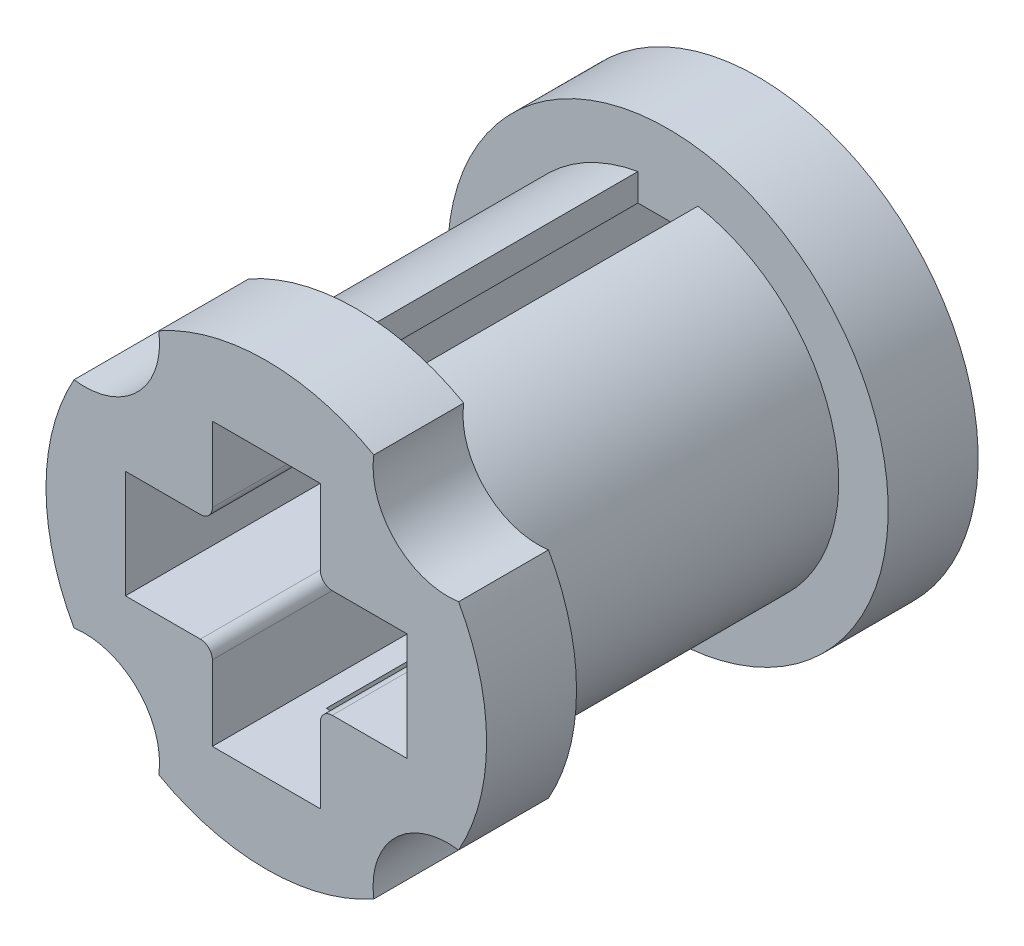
ISO-10303-21;
HEADER;
FILE_DESCRIPTION(('STEP AP214'),'2;1');
FILE_NAME('part.step','',(''),(''),'','','');
FILE_SCHEMA(('AUTOMOTIVE_DESIGN { 1 0 10303 214 1 1 1 1 }'));
ENDSEC;
DATA;
#1=APPLICATION_CONTEXT('core data for automotive mechanical design processes');
#2=APPLICATION_PROTOCOL_DEFINITION('international standard','automotive_design',2000,#1);
#3=PRODUCT_CONTEXT('',#1,'mechanical');
#4=PRODUCT('Part','Part','',(#3));
#5=PRODUCT_RELATED_PRODUCT_CATEGORY('part','',(#4));
#6=PRODUCT_DEFINITION_FORMATION('','',#4);
#7=PRODUCT_DEFINITION_CONTEXT('part definition',#1,'design');
#8=PRODUCT_DEFINITION('design','',#6,#7);
#9=PRODUCT_DEFINITION_SHAPE('','',#8);
#10=(LENGTH_UNIT() NAMED_UNIT(*) SI_UNIT(.MILLI.,.METRE.));
#11=(NAMED_UNIT(*) PLANE_ANGLE_UNIT() SI_UNIT($,.RADIAN.));
#12=(NAMED_UNIT(*) SI_UNIT($,.STERADIAN.) SOLID_ANGLE_UNIT());
#13=UNCERTAINTY_MEASURE_WITH_UNIT(LENGTH_MEASURE(1.E-05),#10,'distance_accuracy_value','');
#14=(GEOMETRIC_REPRESENTATION_CONTEXT(3) GLOBAL_UNCERTAINTY_ASSIGNED_CONTEXT((#13)) GLOBAL_UNIT_ASSIGNED_CONTEXT((#10,
#11,#12)) REPRESENTATION_CONTEXT('',''));
#15=CARTESIAN_POINT('',(0.,0.,0.));
#16=DIRECTION('',(0.,0.,1.));
#17=DIRECTION('',(1.,0.,0.));
#18=AXIS2_PLACEMENT_3D('',#15,#16,#17);
#19=CARTESIAN_POINT('',(0.,0.,-5.2));
#20=DIRECTION('',(0.,0.,1.));
#21=DIRECTION('',(1.,0.,0.));
#22=AXIS2_PLACEMENT_3D('',#19,#20,#21);
#23=CYLINDRICAL_SURFACE('',#22,2.85);
#24=DIRECTION('',(0.,0.,1.));
#25=VECTOR('',#24,1.);
#26=CARTESIAN_POINT('',(-0.500000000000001,-2.80579756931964,-5.2));
#27=LINE('',#26,#25);
#28=CARTESIAN_POINT('',(-0.5,-2.80579756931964,0.));
#29=VERTEX_POINT('',#28);
#30=CARTESIAN_POINT('',(-0.500000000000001,-2.80579756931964,-5.2));
#31=VERTEX_POINT('',#30);
#32=EDGE_CURVE('E246',#29,#31,#27,.F.);
#33=ORIENTED_EDGE('',*,*,#32,.F.);
#34=CARTESIAN_POINT('',(0.,0.,0.));
#35=DIRECTION('',(0.,0.,1.));
#36=DIRECTION('',(1.,0.,0.));
#37=AXIS2_PLACEMENT_3D('',#34,#35,#36);
#38=CIRCLE('',#37,2.85);
#39=CARTESIAN_POINT('',(-0.5,2.80579756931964,0.));
#40=VERTEX_POINT('',#39);
#41=EDGE_CURVE('E260',#40,#29,#38,.T.);
#42=ORIENTED_EDGE('',*,*,#41,.F.);
#43=DIRECTION('',(0.,0.,1.));
#44=VECTOR('',#43,1.);
#45=CARTESIAN_POINT('',(-0.500000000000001,2.80579756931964,-5.2));
#46=LINE('',#45,#44);
#47=CARTESIAN_POINT('',(-0.500000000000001,2.80579756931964,-5.2));
#48=VERTEX_POINT('',#47);
#49=EDGE_CURVE('E264',#48,#40,#46,.T.);
#50=ORIENTED_EDGE('',*,*,#49,.F.);
#51=CARTESIAN_POINT('',(0.,0.,-5.2));
#52=DIRECTION('',(0.,0.,-1.));
#53=DIRECTION('',(-1.,0.,0.));
#54=AXIS2_PLACEMENT_3D('',#51,#52,#53);
#55=CIRCLE('',#54,2.85);
#56=EDGE_CURVE('E262',#48,#31,#55,.F.);
#57=ORIENTED_EDGE('',*,*,#56,.T.);
#58=EDGE_LOOP('',(#33,#42,#50,#57));
#59=FACE_BOUND('',#58,.T.);
#60=ADVANCED_FACE('F33',(#59),#23,.T.);
#61=CARTESIAN_POINT('',(0.,0.,1.5));
#62=DIRECTION('',(0.,0.,-1.));
#63=DIRECTION('',(-1.,0.,0.));
#64=AXIS2_PLACEMENT_3D('',#61,#62,#63);
#65=CYLINDRICAL_SURFACE('',#64,3.675);
#66=CARTESIAN_POINT('',(0.,0.,0.));
#67=DIRECTION('',(0.,0.,1.));
#68=DIRECTION('',(1.,0.,0.));
#69=AXIS2_PLACEMENT_3D('',#66,#67,#68);
#70=CIRCLE('',#69,3.675);
#71=CARTESIAN_POINT('',(-1.79335399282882,-3.20772605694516,0.));
#72=VERTEX_POINT('',#71);
#73=CARTESIAN_POINT('',(1.79335399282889,-3.20772605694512,0.));
#74=VERTEX_POINT('',#73);
#75=EDGE_CURVE('E439',#72,#74,#70,.T.);
#76=ORIENTED_EDGE('',*,*,#75,.T.);
#77=DIRECTION('',(0.,0.,1.));
#78=VECTOR('',#77,1.);
#79=CARTESIAN_POINT('',(1.79335399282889,-3.20772605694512,0.75));
#80=LINE('',#79,#78);
#81=CARTESIAN_POINT('',(1.79335399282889,-3.20772605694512,1.5));
#82=VERTEX_POINT('',#81);
#83=EDGE_CURVE('E495',#74,#82,#80,.T.);
#84=ORIENTED_EDGE('',*,*,#83,.T.);
#85=CARTESIAN_POINT('',(0.,0.,1.5));
#86=DIRECTION('',(0.,0.,1.));
#87=DIRECTION('',(1.,0.,0.));
#88=AXIS2_PLACEMENT_3D('',#85,#86,#87);
#89=CIRCLE('',#88,3.675);
#90=CARTESIAN_POINT('',(-1.79335399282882,-3.20772605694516,1.5));
#91=VERTEX_POINT('',#90);
#92=EDGE_CURVE('E426',#91,#82,#89,.T.);
#93=ORIENTED_EDGE('',*,*,#92,.F.);
#94=DIRECTION('',(0.,0.,1.));
#95=VECTOR('',#94,1.);
#96=CARTESIAN_POINT('',(-1.79335399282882,-3.20772605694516,0.75));
#97=LINE('',#96,#95);
#98=EDGE_CURVE('E502',#91,#72,#97,.F.);
#99=ORIENTED_EDGE('',*,*,#98,.T.);
#100=EDGE_LOOP('',(#76,#84,#93,#99));
#101=FACE_BOUND('',#100,.T.);
#102=ADVANCED_FACE('F544',(#101),#65,.T.);
#103=CARTESIAN_POINT('',(-3.20772605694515,1.79335399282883,0.));
#104=VERTEX_POINT('',#103);
#105=CARTESIAN_POINT('',(-3.20772605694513,-1.79335399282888,0.));
#106=VERTEX_POINT('',#105);
#107=EDGE_CURVE('E431',#104,#106,#70,.T.);
#108=ORIENTED_EDGE('',*,*,#107,.T.);
#109=DIRECTION('',(0.,0.,1.));
#110=VECTOR('',#109,1.);
#111=CARTESIAN_POINT('',(-3.20772605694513,-1.79335399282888,0.75));
#112=LINE('',#111,#110);
#113=CARTESIAN_POINT('',(-3.20772605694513,-1.79335399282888,1.5));
#114=VERTEX_POINT('',#113);
#115=EDGE_CURVE('E506',#106,#114,#112,.T.);
#116=ORIENTED_EDGE('',*,*,#115,.T.);
#117=CARTESIAN_POINT('',(-3.20772605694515,1.79335399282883,1.5));
#118=VERTEX_POINT('',#117);
#119=EDGE_CURVE('E419',#118,#114,#89,.T.);
#120=ORIENTED_EDGE('',*,*,#119,.F.);
#121=DIRECTION('',(0.,0.,1.));
#122=VECTOR('',#121,1.);
#123=CARTESIAN_POINT('',(-3.20772605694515,1.79335399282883,0.75));
#124=LINE('',#123,#122);
#125=EDGE_CURVE('E513',#118,#104,#124,.F.);
#126=ORIENTED_EDGE('',*,*,#125,.T.);
#127=EDGE_LOOP('',(#108,#116,#120,#126));
#128=FACE_BOUND('',#127,.T.);
#129=ADVANCED_FACE('F533',(#128),#65,.T.);
#130=CARTESIAN_POINT('',(1.79335399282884,3.20772605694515,0.));
#131=VERTEX_POINT('',#130);
#132=CARTESIAN_POINT('',(-1.79335399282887,3.20772605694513,0.));
#133=VERTEX_POINT('',#132);
#134=EDGE_CURVE('E279',#131,#133,#70,.T.);
#135=ORIENTED_EDGE('',*,*,#134,.T.);
#136=DIRECTION('',(0.,0.,1.));
#137=VECTOR('',#136,1.);
#138=CARTESIAN_POINT('',(-1.79335399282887,3.20772605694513,0.75));
#139=LINE('',#138,#137);
#140=CARTESIAN_POINT('',(-1.79335399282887,3.20772605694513,1.5));
#141=VERTEX_POINT('',#140);
#142=EDGE_CURVE('E517',#133,#141,#139,.T.);
#143=ORIENTED_EDGE('',*,*,#142,.T.);
#144=CARTESIAN_POINT('',(1.79335399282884,3.20772605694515,1.5));
#145=VERTEX_POINT('',#144);
#146=EDGE_CURVE('E277',#145,#141,#89,.T.);
#147=ORIENTED_EDGE('',*,*,#146,.F.);
#148=DIRECTION('',(0.,0.,1.));
#149=VECTOR('',#148,1.);
#150=CARTESIAN_POINT('',(1.79335399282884,3.20772605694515,0.75));
#151=LINE('',#150,#149);
#152=EDGE_CURVE('E523',#145,#131,#151,.F.);
#153=ORIENTED_EDGE('',*,*,#152,.T.);
#154=EDGE_LOOP('',(#135,#143,#147,#153));
#155=FACE_BOUND('',#154,.T.);
#156=ADVANCED_FACE('F536',(#155),#65,.T.);
#157=DIRECTION('',(0.,0.,1.));
#158=VECTOR('',#157,1.);
#159=CARTESIAN_POINT('',(0.499999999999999,2.80579756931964,-5.2));
#160=LINE('',#159,#158);
#161=CARTESIAN_POINT('',(0.5,2.80579756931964,0.));
#162=VERTEX_POINT('',#161);
#163=CARTESIAN_POINT('',(0.499999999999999,2.80579756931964,-5.2));
#164=VERTEX_POINT('',#163);
#165=EDGE_CURVE('E452',#162,#164,#160,.F.);
#166=ORIENTED_EDGE('',*,*,#165,.F.);
#167=CARTESIAN_POINT('',(0.5,-2.80579756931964,0.));
#168=VERTEX_POINT('',#167);
#169=EDGE_CURVE('E272',#168,#162,#38,.T.);
#170=ORIENTED_EDGE('',*,*,#169,.F.);
#171=DIRECTION('',(0.,0.,1.));
#172=VECTOR('',#171,1.);
#173=CARTESIAN_POINT('',(0.499999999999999,-2.80579756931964,-5.2));
#174=LINE('',#173,#172);
#175=CARTESIAN_POINT('',(0.499999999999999,-2.80579756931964,-5.2));
#176=VERTEX_POINT('',#175);
#177=EDGE_CURVE('E454',#176,#168,#174,.T.);
#178=ORIENTED_EDGE('',*,*,#177,.F.);
#179=EDGE_CURVE('E417',#176,#164,#55,.F.);
#180=ORIENTED_EDGE('',*,*,#179,.T.);
#181=EDGE_LOOP('',(#166,#170,#178,#180));
#182=FACE_BOUND('',#181,.T.);
#183=ADVANCED_FACE('F450',(#182),#23,.T.);
#184=CARTESIAN_POINT('',(3.20772605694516,-1.79335399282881,1.5));
#185=VERTEX_POINT('',#184);
#186=CARTESIAN_POINT('',(3.20772605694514,1.79335399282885,1.5));
#187=VERTEX_POINT('',#186);
#188=EDGE_CURVE('E420',#185,#187,#89,.T.);
#189=ORIENTED_EDGE('',*,*,#188,.F.);
#190=DIRECTION('',(0.,0.,1.));
#191=VECTOR('',#190,1.);
#192=CARTESIAN_POINT('',(3.20772605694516,-1.79335399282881,0.75));
#193=LINE('',#192,#191);
#194=CARTESIAN_POINT('',(3.20772605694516,-1.79335399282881,0.));
#195=VERTEX_POINT('',#194);
#196=EDGE_CURVE('E492',#185,#195,#193,.F.);
#197=ORIENTED_EDGE('',*,*,#196,.T.);
#198=CARTESIAN_POINT('',(3.20772605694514,1.79335399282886,0.));
#199=VERTEX_POINT('',#198);
#200=EDGE_CURVE('E432',#195,#199,#70,.T.);
#201=ORIENTED_EDGE('',*,*,#200,.T.);
#202=DIRECTION('',(0.,0.,1.));
#203=VECTOR('',#202,1.);
#204=CARTESIAN_POINT('',(3.20772605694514,1.79335399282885,0.75));
#205=LINE('',#204,#203);
#206=EDGE_CURVE('E366',#199,#187,#205,.T.);
#207=ORIENTED_EDGE('',*,*,#206,.T.);
#208=EDGE_LOOP('',(#189,#197,#201,#207));
#209=FACE_BOUND('',#208,.T.);
#210=ADVANCED_FACE('F525',(#209),#65,.T.);
#211=CARTESIAN_POINT('',(0.,0.,1.5));
#212=DIRECTION('',(0.,0.,1.));
#213=DIRECTION('',(1.,0.,0.));
#214=AXIS2_PLACEMENT_3D('',#211,#212,#213);
#215=PLANE('',#214);
#216=CARTESIAN_POINT('',(3.03076442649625,-3.03076442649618,1.5));
#217=DIRECTION('',(0.,0.,1.));
#218=DIRECTION('',(0.,-1.,0.));
#219=AXIS2_PLACEMENT_3D('',#216,#217,#218);
#220=CIRCLE('',#219,1.25);
#221=EDGE_CURVE('E263',#185,#82,#220,.T.);
#222=ORIENTED_EDGE('',*,*,#221,.F.);
#223=ORIENTED_EDGE('',*,*,#188,.T.);
#224=CARTESIAN_POINT('',(3.03076442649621,3.03076442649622,1.5));
#225=DIRECTION('',(0.,0.,1.));
#226=DIRECTION('',(1.,0.,0.));
#227=AXIS2_PLACEMENT_3D('',#224,#225,#226);
#228=CIRCLE('',#227,1.25);
#229=EDGE_CURVE('E519',#145,#187,#228,.T.);
#230=ORIENTED_EDGE('',*,*,#229,.F.);
#231=ORIENTED_EDGE('',*,*,#146,.T.);
#232=CARTESIAN_POINT('',(-3.03076442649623,3.0307644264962,1.5));
#233=DIRECTION('',(0.,0.,1.));
#234=DIRECTION('',(0.,1.,0.));
#235=AXIS2_PLACEMENT_3D('',#232,#233,#234);
#236=CIRCLE('',#235,1.25);
#237=EDGE_CURVE('E509',#118,#141,#236,.T.);
#238=ORIENTED_EDGE('',*,*,#237,.F.);
#239=ORIENTED_EDGE('',*,*,#119,.T.);
#240=CARTESIAN_POINT('',(-3.03076442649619,-3.03076442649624,1.5));
#241=DIRECTION('',(0.,0.,1.));
#242=DIRECTION('',(-1.,0.,0.));
#243=AXIS2_PLACEMENT_3D('',#240,#241,#242);
#244=CIRCLE('',#243,1.25);
#245=EDGE_CURVE('E498',#91,#114,#244,.T.);
#246=ORIENTED_EDGE('',*,*,#245,.F.);
#247=ORIENTED_EDGE('',*,*,#92,.T.);
#248=EDGE_LOOP('',(#222,#223,#230,#231,#238,#239,#246,#247));
#249=FACE_BOUND('',#248,.T.);
#250=DIRECTION('',(0.,-1.,0.));
#251=VECTOR('',#250,1.);
#252=CARTESIAN_POINT('',(-0.900000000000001,-0.9,1.5));
#253=LINE('',#252,#251);
#254=CARTESIAN_POINT('',(-0.900000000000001,-1.1,1.5));
#255=VERTEX_POINT('',#254);
#256=CARTESIAN_POINT('',(-0.9,-2.35,1.5));
#257=VERTEX_POINT('',#256);
#258=EDGE_CURVE('E372',#255,#257,#253,.T.);
#259=ORIENTED_EDGE('',*,*,#258,.F.);
#260=CARTESIAN_POINT('',(-1.1,-1.1,1.5));
#261=DIRECTION('',(0.,0.,1.));
#262=DIRECTION('',(1.,0.,0.));
#263=AXIS2_PLACEMENT_3D('',#260,#261,#262);
#264=CIRCLE('',#263,0.2);
#265=CARTESIAN_POINT('',(-1.1,-0.9,1.5));
#266=VERTEX_POINT('',#265);
#267=EDGE_CURVE('E324',#255,#266,#264,.T.);
#268=ORIENTED_EDGE('',*,*,#267,.T.);
#269=DIRECTION('',(1.,0.,0.));
#270=VECTOR('',#269,1.);
#271=CARTESIAN_POINT('',(-2.35,-0.9,1.5));
#272=LINE('',#271,#270);
#273=CARTESIAN_POINT('',(-2.35,-0.9,1.5));
#274=VERTEX_POINT('',#273);
#275=EDGE_CURVE('E364',#274,#266,#272,.T.);
#276=ORIENTED_EDGE('',*,*,#275,.F.);
#277=DIRECTION('',(0.,-1.,0.));
#278=VECTOR('',#277,1.);
#279=CARTESIAN_POINT('',(-2.35,0.9,1.5));
#280=LINE('',#279,#278);
#281=CARTESIAN_POINT('',(-2.35,0.9,1.5));
#282=VERTEX_POINT('',#281);
#283=EDGE_CURVE('E361',#282,#274,#280,.T.);
#284=ORIENTED_EDGE('',*,*,#283,.F.);
#285=DIRECTION('',(-1.,0.,0.));
#286=VECTOR('',#285,1.);
#287=CARTESIAN_POINT('',(-2.35,0.9,1.5));
#288=LINE('',#287,#286);
#289=CARTESIAN_POINT('',(-1.1,0.9,1.5));
#290=VERTEX_POINT('',#289);
#291=EDGE_CURVE('E348',#290,#282,#288,.T.);
#292=ORIENTED_EDGE('',*,*,#291,.F.);
#293=CARTESIAN_POINT('',(-1.1,1.1,1.5));
#294=DIRECTION('',(0.,0.,1.));
#295=DIRECTION('',(1.,0.,0.));
#296=AXIS2_PLACEMENT_3D('',#293,#294,#295);
#297=CIRCLE('',#296,0.2);
#298=CARTESIAN_POINT('',(-0.900000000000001,1.1,1.5));
#299=VERTEX_POINT('',#298);
#300=EDGE_CURVE('E318',#290,#299,#297,.T.);
#301=ORIENTED_EDGE('',*,*,#300,.T.);
#302=DIRECTION('',(0.,-1.,0.));
#303=VECTOR('',#302,1.);
#304=CARTESIAN_POINT('',(-0.9,2.35,1.5));
#305=LINE('',#304,#303);
#306=CARTESIAN_POINT('',(-0.9,2.35,1.5));
#307=VERTEX_POINT('',#306);
#308=EDGE_CURVE('E362',#307,#299,#305,.T.);
#309=ORIENTED_EDGE('',*,*,#308,.F.);
#310=DIRECTION('',(-1.,0.,0.));
#311=VECTOR('',#310,1.);
#312=CARTESIAN_POINT('',(-0.9,2.35,1.5));
#313=LINE('',#312,#311);
#314=CARTESIAN_POINT('',(0.9,2.35,1.5));
#315=VERTEX_POINT('',#314);
#316=EDGE_CURVE('E389',#315,#307,#313,.T.);
#317=ORIENTED_EDGE('',*,*,#316,.F.);
#318=DIRECTION('',(0.,1.,0.));
#319=VECTOR('',#318,1.);
#320=CARTESIAN_POINT('',(0.9,2.35,1.5));
#321=LINE('',#320,#319);
#322=CARTESIAN_POINT('',(0.900000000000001,1.1,1.5));
#323=VERTEX_POINT('',#322);
#324=EDGE_CURVE('E387',#323,#315,#321,.T.);
#325=ORIENTED_EDGE('',*,*,#324,.F.);
#326=CARTESIAN_POINT('',(1.1,1.1,1.5));
#327=DIRECTION('',(0.,0.,1.));
#328=DIRECTION('',(1.,0.,0.));
#329=AXIS2_PLACEMENT_3D('',#326,#327,#328);
#330=CIRCLE('',#329,0.2);
#331=CARTESIAN_POINT('',(1.1,0.9,1.5));
#332=VERTEX_POINT('',#331);
#333=EDGE_CURVE('E320',#323,#332,#330,.T.);
#334=ORIENTED_EDGE('',*,*,#333,.T.);
#335=DIRECTION('',(-1.,0.,0.));
#336=VECTOR('',#335,1.);
#337=CARTESIAN_POINT('',(0.900000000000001,0.9,1.5));
#338=LINE('',#337,#336);
#339=CARTESIAN_POINT('',(2.35,0.9,1.5));
#340=VERTEX_POINT('',#339);
#341=EDGE_CURVE('E385',#340,#332,#338,.T.);
#342=ORIENTED_EDGE('',*,*,#341,.F.);
#343=DIRECTION('',(0.,1.,0.));
#344=VECTOR('',#343,1.);
#345=CARTESIAN_POINT('',(2.35,0.9,1.5));
#346=LINE('',#345,#344);
#347=CARTESIAN_POINT('',(2.35,-0.9,1.5));
#348=VERTEX_POINT('',#347);
#349=EDGE_CURVE('E382',#348,#340,#346,.T.);
#350=ORIENTED_EDGE('',*,*,#349,.F.);
#351=DIRECTION('',(1.,0.,0.));
#352=VECTOR('',#351,1.);
#353=CARTESIAN_POINT('',(0.900000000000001,-0.9,1.5));
#354=LINE('',#353,#352);
#355=CARTESIAN_POINT('',(1.1,-0.9,1.5));
#356=VERTEX_POINT('',#355);
#357=EDGE_CURVE('E380',#356,#348,#354,.T.);
#358=ORIENTED_EDGE('',*,*,#357,.F.);
#359=CARTESIAN_POINT('',(1.1,-1.1,1.5));
#360=DIRECTION('',(0.,0.,1.));
#361=DIRECTION('',(1.,0.,0.));
#362=AXIS2_PLACEMENT_3D('',#359,#360,#361);
#363=CIRCLE('',#362,0.2);
#364=CARTESIAN_POINT('',(0.900000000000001,-1.1,1.5));
#365=VERTEX_POINT('',#364);
#366=EDGE_CURVE('E322',#356,#365,#363,.T.);
#367=ORIENTED_EDGE('',*,*,#366,.T.);
#368=DIRECTION('',(0.,1.,0.));
#369=VECTOR('',#368,1.);
#370=CARTESIAN_POINT('',(0.900000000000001,-0.9,1.5));
#371=LINE('',#370,#369);
#372=CARTESIAN_POINT('',(0.900000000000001,-2.35,1.5));
#373=VERTEX_POINT('',#372);
#374=EDGE_CURVE('E377',#373,#365,#371,.T.);
#375=ORIENTED_EDGE('',*,*,#374,.F.);
#376=DIRECTION('',(1.,0.,0.));
#377=VECTOR('',#376,1.);
#378=CARTESIAN_POINT('',(-0.9,-2.35,1.5));
#379=LINE('',#378,#377);
#380=EDGE_CURVE('E374',#257,#373,#379,.T.);
#381=ORIENTED_EDGE('',*,*,#380,.F.);
#382=EDGE_LOOP('',(#259,#268,#276,#284,#292,#301,#309,#317,#325,#334,#342,#350,#358,#367,#375,#381));
#383=FACE_BOUND('',#382,.T.);
#384=ADVANCED_FACE('F356',(#249,#383),#215,.T.);
#385=CARTESIAN_POINT('',(0.,0.,0.));
#386=DIRECTION('',(0.,0.,1.));
#387=DIRECTION('',(1.,0.,0.));
#388=AXIS2_PLACEMENT_3D('',#385,#386,#387);
#389=PLANE('',#388);
#390=ORIENTED_EDGE('',*,*,#169,.T.);
#391=DIRECTION('',(0.,1.,0.));
#392=VECTOR('',#391,1.);
#393=CARTESIAN_POINT('',(0.5,-6.75,0.));
#394=LINE('',#393,#392);
#395=CARTESIAN_POINT('',(0.5,2.35,0.));
#396=VERTEX_POINT('',#395);
#397=EDGE_CURVE('E253',#396,#162,#394,.T.);
#398=ORIENTED_EDGE('',*,*,#397,.F.);
#399=DIRECTION('',(1.,0.,0.));
#400=VECTOR('',#399,1.);
#401=CARTESIAN_POINT('',(-0.9,2.35,0.));
#402=LINE('',#401,#400);
#403=CARTESIAN_POINT('',(-0.5,2.35,0.));
#404=VERTEX_POINT('',#403);
#405=EDGE_CURVE('E476',#404,#396,#402,.T.);
#406=ORIENTED_EDGE('',*,*,#405,.F.);
#407=DIRECTION('',(0.,1.,0.));
#408=VECTOR('',#407,1.);
#409=CARTESIAN_POINT('',(-0.5,-6.75,0.));
#410=LINE('',#409,#408);
#411=EDGE_CURVE('E254',#404,#40,#410,.T.);
#412=ORIENTED_EDGE('',*,*,#411,.T.);
#413=ORIENTED_EDGE('',*,*,#41,.T.);
#414=CARTESIAN_POINT('',(-0.5,-2.35,0.));
#415=VERTEX_POINT('',#414);
#416=EDGE_CURVE('E242',#29,#415,#410,.T.);
#417=ORIENTED_EDGE('',*,*,#416,.T.);
#418=DIRECTION('',(-1.,0.,0.));
#419=VECTOR('',#418,1.);
#420=CARTESIAN_POINT('',(-0.9,-2.35,0.));
#421=LINE('',#420,#419);
#422=CARTESIAN_POINT('',(0.5,-2.35,0.));
#423=VERTEX_POINT('',#422);
#424=EDGE_CURVE('E306',#423,#415,#421,.T.);
#425=ORIENTED_EDGE('',*,*,#424,.F.);
#426=EDGE_CURVE('E469',#168,#423,#394,.T.);
#427=ORIENTED_EDGE('',*,*,#426,.F.);
#428=EDGE_LOOP('',(#390,#398,#406,#412,#413,#417,#425,#427));
#429=FACE_BOUND('',#428,.T.);
#430=CARTESIAN_POINT('',(3.03076442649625,-3.03076442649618,0.));
#431=DIRECTION('',(0.,0.,1.));
#432=DIRECTION('',(0.,-1.,0.));
#433=AXIS2_PLACEMENT_3D('',#430,#431,#432);
#434=CIRCLE('',#433,1.25);
#435=EDGE_CURVE('E489',#195,#74,#434,.T.);
#436=ORIENTED_EDGE('',*,*,#435,.T.);
#437=ORIENTED_EDGE('',*,*,#75,.F.);
#438=CARTESIAN_POINT('',(-3.03076442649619,-3.03076442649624,0.));
#439=DIRECTION('',(0.,0.,1.));
#440=DIRECTION('',(-1.,0.,0.));
#441=AXIS2_PLACEMENT_3D('',#438,#439,#440);
#442=CIRCLE('',#441,1.25);
#443=EDGE_CURVE('E499',#72,#106,#442,.T.);
#444=ORIENTED_EDGE('',*,*,#443,.T.);
#445=ORIENTED_EDGE('',*,*,#107,.F.);
#446=CARTESIAN_POINT('',(-3.03076442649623,3.0307644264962,0.));
#447=DIRECTION('',(0.,0.,1.));
#448=DIRECTION('',(0.,1.,0.));
#449=AXIS2_PLACEMENT_3D('',#446,#447,#448);
#450=CIRCLE('',#449,1.25);
#451=EDGE_CURVE('E510',#104,#133,#450,.T.);
#452=ORIENTED_EDGE('',*,*,#451,.T.);
#453=ORIENTED_EDGE('',*,*,#134,.F.);
#454=CARTESIAN_POINT('',(3.03076442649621,3.03076442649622,0.));
#455=DIRECTION('',(0.,0.,1.));
#456=DIRECTION('',(1.,0.,0.));
#457=AXIS2_PLACEMENT_3D('',#454,#455,#456);
#458=CIRCLE('',#457,1.25);
#459=EDGE_CURVE('E520',#131,#199,#458,.T.);
#460=ORIENTED_EDGE('',*,*,#459,.T.);
#461=ORIENTED_EDGE('',*,*,#200,.F.);
#462=EDGE_LOOP('',(#436,#437,#444,#445,#452,#453,#460,#461));
#463=FACE_BOUND('',#462,.T.);
#464=ADVANCED_FACE('F267',(#429,#463),#389,.F.);
#465=CARTESIAN_POINT('',(0.,0.,-6.7));
#466=DIRECTION('',(0.,0.,1.));
#467=DIRECTION('',(1.,0.,0.));
#468=AXIS2_PLACEMENT_3D('',#465,#466,#467);
#469=CYLINDRICAL_SURFACE('',#468,3.675);
#470=CARTESIAN_POINT('',(0.,0.,-6.7));
#471=DIRECTION('',(0.,0.,-1.));
#472=DIRECTION('',(-1.,0.,0.));
#473=AXIS2_PLACEMENT_3D('',#470,#471,#472);
#474=CIRCLE('',#473,3.675);
#475=CARTESIAN_POINT('',(-3.675,0.,-6.7));
#476=VERTEX_POINT('',#475);
#477=EDGE_CURVE('E412',#476,#476,#474,.T.);
#478=ORIENTED_EDGE('',*,*,#477,.F.);
#479=EDGE_LOOP('',(#478));
#480=FACE_BOUND('',#479,.T.);
#481=CARTESIAN_POINT('',(0.,0.,-5.2));
#482=DIRECTION('',(0.,0.,-1.));
#483=DIRECTION('',(-1.,0.,0.));
#484=AXIS2_PLACEMENT_3D('',#481,#482,#483);
#485=CIRCLE('',#484,3.675);
#486=CARTESIAN_POINT('',(-3.675,0.,-5.2));
#487=VERTEX_POINT('',#486);
#488=EDGE_CURVE('E395',#487,#487,#485,.T.);
#489=ORIENTED_EDGE('',*,*,#488,.T.);
#490=EDGE_LOOP('',(#489));
#491=FACE_BOUND('',#490,.T.);
#492=ADVANCED_FACE('F598',(#480,#491),#469,.T.);
#493=CARTESIAN_POINT('',(0.,0.,-6.7));
#494=DIRECTION('',(0.,0.,-1.));
#495=DIRECTION('',(-1.,0.,0.));
#496=AXIS2_PLACEMENT_3D('',#493,#494,#495);
#497=PLANE('',#496);
#498=DIRECTION('',(-1.,0.,0.));
#499=VECTOR('',#498,1.);
#500=CARTESIAN_POINT('',(0.,-0.9,-6.7));
#501=LINE('',#500,#499);
#502=CARTESIAN_POINT('',(-1.1,-0.9,-6.7));
#503=VERTEX_POINT('',#502);
#504=CARTESIAN_POINT('',(-2.35,-0.9,-6.7));
#505=VERTEX_POINT('',#504);
#506=EDGE_CURVE('E284',#503,#505,#501,.T.);
#507=ORIENTED_EDGE('',*,*,#506,.F.);
#508=CARTESIAN_POINT('',(-1.1,-1.1,-6.7));
#509=DIRECTION('',(0.,0.,-1.));
#510=DIRECTION('',(-1.,0.,0.));
#511=AXIS2_PLACEMENT_3D('',#508,#509,#510);
#512=CIRCLE('',#511,0.2);
#513=CARTESIAN_POINT('',(-0.9,-1.1,-6.7));
#514=VERTEX_POINT('',#513);
#515=EDGE_CURVE('E333',#503,#514,#512,.T.);
#516=ORIENTED_EDGE('',*,*,#515,.T.);
#517=DIRECTION('',(0.,1.,0.));
#518=VECTOR('',#517,1.);
#519=CARTESIAN_POINT('',(-0.900000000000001,0.,-6.7));
#520=LINE('',#519,#518);
#521=CARTESIAN_POINT('',(-0.9,-2.35,-6.7));
#522=VERTEX_POINT('',#521);
#523=EDGE_CURVE('E286',#522,#514,#520,.T.);
#524=ORIENTED_EDGE('',*,*,#523,.F.);
#525=DIRECTION('',(-1.,0.,0.));
#526=VECTOR('',#525,1.);
#527=CARTESIAN_POINT('',(0.,-2.35,-6.7));
#528=LINE('',#527,#526);
#529=CARTESIAN_POINT('',(0.900000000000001,-2.35,-6.7));
#530=VERTEX_POINT('',#529);
#531=EDGE_CURVE('E289',#530,#522,#528,.T.);
#532=ORIENTED_EDGE('',*,*,#531,.F.);
#533=DIRECTION('',(0.,-1.,0.));
#534=VECTOR('',#533,1.);
#535=CARTESIAN_POINT('',(0.900000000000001,0.,-6.7));
#536=LINE('',#535,#534);
#537=CARTESIAN_POINT('',(0.900000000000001,-1.1,-6.7));
#538=VERTEX_POINT('',#537);
#539=EDGE_CURVE('E291',#538,#530,#536,.T.);
#540=ORIENTED_EDGE('',*,*,#539,.F.);
#541=CARTESIAN_POINT('',(1.1,-1.1,-6.7));
#542=DIRECTION('',(0.,0.,-1.));
#543=DIRECTION('',(-1.,0.,0.));
#544=AXIS2_PLACEMENT_3D('',#541,#542,#543);
#545=CIRCLE('',#544,0.2);
#546=CARTESIAN_POINT('',(1.1,-0.9,-6.7));
#547=VERTEX_POINT('',#546);
#548=EDGE_CURVE('E331',#538,#547,#545,.T.);
#549=ORIENTED_EDGE('',*,*,#548,.T.);
#550=DIRECTION('',(-1.,0.,0.));
#551=VECTOR('',#550,1.);
#552=CARTESIAN_POINT('',(0.,-0.9,-6.7));
#553=LINE('',#552,#551);
#554=CARTESIAN_POINT('',(2.35,-0.9,-6.7));
#555=VERTEX_POINT('',#554);
#556=EDGE_CURVE('E293',#555,#547,#553,.T.);
#557=ORIENTED_EDGE('',*,*,#556,.F.);
#558=DIRECTION('',(0.,-1.,0.));
#559=VECTOR('',#558,1.);
#560=CARTESIAN_POINT('',(2.35,0.,-6.7));
#561=LINE('',#560,#559);
#562=CARTESIAN_POINT('',(2.35,0.9,-6.7));
#563=VERTEX_POINT('',#562);
#564=EDGE_CURVE('E296',#563,#555,#561,.T.);
#565=ORIENTED_EDGE('',*,*,#564,.F.);
#566=DIRECTION('',(1.,0.,0.));
#567=VECTOR('',#566,1.);
#568=CARTESIAN_POINT('',(0.,0.9,-6.7));
#569=LINE('',#568,#567);
#570=CARTESIAN_POINT('',(1.1,0.9,-6.7));
#571=VERTEX_POINT('',#570);
#572=EDGE_CURVE('E298',#571,#563,#569,.T.);
#573=ORIENTED_EDGE('',*,*,#572,.F.);
#574=CARTESIAN_POINT('',(1.1,1.1,-6.7));
#575=DIRECTION('',(0.,0.,-1.));
#576=DIRECTION('',(-1.,0.,0.));
#577=AXIS2_PLACEMENT_3D('',#574,#575,#576);
#578=CIRCLE('',#577,0.2);
#579=CARTESIAN_POINT('',(0.900000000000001,1.1,-6.7));
#580=VERTEX_POINT('',#579);
#581=EDGE_CURVE('E48',#571,#580,#578,.T.);
#582=ORIENTED_EDGE('',*,*,#581,.T.);
#583=DIRECTION('',(0.,-1.,0.));
#584=VECTOR('',#583,1.);
#585=CARTESIAN_POINT('',(0.900000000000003,0.,-6.7));
#586=LINE('',#585,#584);
#587=CARTESIAN_POINT('',(0.9,2.35,-6.7));
#588=VERTEX_POINT('',#587);
#589=EDGE_CURVE('E300',#588,#580,#586,.T.);
#590=ORIENTED_EDGE('',*,*,#589,.F.);
#591=DIRECTION('',(1.,0.,0.));
#592=VECTOR('',#591,1.);
#593=CARTESIAN_POINT('',(0.,2.35,-6.7));
#594=LINE('',#593,#592);
#595=CARTESIAN_POINT('',(-0.9,2.35,-6.7));
#596=VERTEX_POINT('',#595);
#597=EDGE_CURVE('E302',#596,#588,#594,.T.);
#598=ORIENTED_EDGE('',*,*,#597,.F.);
#599=DIRECTION('',(0.,1.,0.));
#600=VECTOR('',#599,1.);
#601=CARTESIAN_POINT('',(-0.900000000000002,0.,-6.7));
#602=LINE('',#601,#600);
#603=CARTESIAN_POINT('',(-0.900000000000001,1.1,-6.7));
#604=VERTEX_POINT('',#603);
#605=EDGE_CURVE('E304',#604,#596,#602,.T.);
#606=ORIENTED_EDGE('',*,*,#605,.F.);
#607=CARTESIAN_POINT('',(-1.1,1.1,-6.7));
#608=DIRECTION('',(0.,0.,-1.));
#609=DIRECTION('',(-1.,0.,0.));
#610=AXIS2_PLACEMENT_3D('',#607,#608,#609);
#611=CIRCLE('',#610,0.2);
#612=CARTESIAN_POINT('',(-1.1,0.9,-6.7));
#613=VERTEX_POINT('',#612);
#614=EDGE_CURVE('E328',#604,#613,#611,.T.);
#615=ORIENTED_EDGE('',*,*,#614,.T.);
#616=DIRECTION('',(1.,0.,0.));
#617=VECTOR('',#616,1.);
#618=CARTESIAN_POINT('',(0.,0.899999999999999,-6.7));
#619=LINE('',#618,#617);
#620=CARTESIAN_POINT('',(-2.35,0.9,-6.7));
#621=VERTEX_POINT('',#620);
#622=EDGE_CURVE('E271',#621,#613,#619,.T.);
#623=ORIENTED_EDGE('',*,*,#622,.F.);
#624=DIRECTION('',(0.,1.,0.));
#625=VECTOR('',#624,1.);
#626=CARTESIAN_POINT('',(-2.35,0.,-6.7));
#627=LINE('',#626,#625);
#628=EDGE_CURVE('E275',#505,#621,#627,.T.);
#629=ORIENTED_EDGE('',*,*,#628,.F.);
#630=EDGE_LOOP('',(#507,#516,#524,#532,#540,#549,#557,#565,#573,#582,#590,#598,#606,#615,#623,#629));
#631=FACE_BOUND('',#630,.T.);
#632=ORIENTED_EDGE('',*,*,#477,.T.);
#633=EDGE_LOOP('',(#632));
#634=FACE_BOUND('',#633,.T.);
#635=ADVANCED_FACE('F579',(#631,#634),#497,.T.);
#636=CARTESIAN_POINT('',(0.,0.,-5.2));
#637=DIRECTION('',(0.,0.,-1.));
#638=DIRECTION('',(-1.,0.,0.));
#639=AXIS2_PLACEMENT_3D('',#636,#637,#638);
#640=PLANE('',#639);
#641=ORIENTED_EDGE('',*,*,#179,.F.);
#642=DIRECTION('',(0.,1.,0.));
#643=VECTOR('',#642,1.);
#644=CARTESIAN_POINT('',(0.499999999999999,-6.75,-5.2));
#645=LINE('',#644,#643);
#646=CARTESIAN_POINT('',(0.499999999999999,-2.35,-5.2));
#647=VERTEX_POINT('',#646);
#648=EDGE_CURVE('E460',#176,#647,#645,.T.);
#649=ORIENTED_EDGE('',*,*,#648,.T.);
#650=DIRECTION('',(1.,0.,0.));
#651=VECTOR('',#650,1.);
#652=CARTESIAN_POINT('',(-0.9,-2.35,-5.2));
#653=LINE('',#652,#651);
#654=CARTESIAN_POINT('',(-0.500000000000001,-2.35,-5.2));
#655=VERTEX_POINT('',#654);
#656=EDGE_CURVE('E311',#655,#647,#653,.T.);
#657=ORIENTED_EDGE('',*,*,#656,.F.);
#658=DIRECTION('',(0.,1.,0.));
#659=VECTOR('',#658,1.);
#660=CARTESIAN_POINT('',(-0.500000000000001,-6.75,-5.2));
#661=LINE('',#660,#659);
#662=EDGE_CURVE('E480',#31,#655,#661,.T.);
#663=ORIENTED_EDGE('',*,*,#662,.F.);
#664=ORIENTED_EDGE('',*,*,#56,.F.);
#665=CARTESIAN_POINT('',(-0.500000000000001,2.35,-5.2));
#666=VERTEX_POINT('',#665);
#667=EDGE_CURVE('E471',#666,#48,#661,.T.);
#668=ORIENTED_EDGE('',*,*,#667,.F.);
#669=DIRECTION('',(-1.,0.,0.));
#670=VECTOR('',#669,1.);
#671=CARTESIAN_POINT('',(-0.9,2.35,-5.2));
#672=LINE('',#671,#670);
#673=CARTESIAN_POINT('',(0.499999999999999,2.35,-5.2));
#674=VERTEX_POINT('',#673);
#675=EDGE_CURVE('E465',#674,#666,#672,.T.);
#676=ORIENTED_EDGE('',*,*,#675,.F.);
#677=EDGE_CURVE('E462',#674,#164,#645,.T.);
#678=ORIENTED_EDGE('',*,*,#677,.T.);
#679=EDGE_LOOP('',(#641,#649,#657,#663,#664,#668,#676,#678));
#680=FACE_BOUND('',#679,.T.);
#681=ORIENTED_EDGE('',*,*,#488,.F.);
#682=EDGE_LOOP('',(#681));
#683=FACE_BOUND('',#682,.T.);
#684=ADVANCED_FACE('F458',(#680,#683),#640,.F.);
#685=CARTESIAN_POINT('',(-0.9,2.35,-7.5));
#686=DIRECTION('',(-1.,0.,0.));
#687=DIRECTION('',(0.,-1.,0.));
#688=AXIS2_PLACEMENT_3D('',#685,#686,#687);
#689=PLANE('',#688);
#690=ORIENTED_EDGE('',*,*,#308,.T.);
#691=DIRECTION('',(0.,0.,1.));
#692=VECTOR('',#691,1.);
#693=CARTESIAN_POINT('',(-0.900000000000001,1.1,-7.5));
#694=LINE('',#693,#692);
#695=EDGE_CURVE('E11',#299,#604,#694,.F.);
#696=ORIENTED_EDGE('',*,*,#695,.T.);
#697=ORIENTED_EDGE('',*,*,#605,.T.);
#698=DIRECTION('',(0.,0.,1.));
#699=VECTOR('',#698,1.);
#700=CARTESIAN_POINT('',(-0.9,2.35,-7.5));
#701=LINE('',#700,#699);
#702=EDGE_CURVE('E393',#596,#307,#701,.T.);
#703=ORIENTED_EDGE('',*,*,#702,.T.);
#704=EDGE_LOOP('',(#690,#696,#697,#703));
#705=FACE_BOUND('',#704,.T.);
#706=ADVANCED_FACE('F584',(#705),#689,.F.);
#707=CARTESIAN_POINT('',(-0.9,2.35,-7.5));
#708=DIRECTION('',(0.,1.,0.));
#709=DIRECTION('',(-1.,0.,0.));
#710=AXIS2_PLACEMENT_3D('',#707,#708,#709);
#711=PLANE('',#710);
#712=ORIENTED_EDGE('',*,*,#675,.T.);
#713=DIRECTION('',(0.,0.,1.));
#714=VECTOR('',#713,1.);
#715=CARTESIAN_POINT('',(-0.500000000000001,2.35,-7.5));
#716=LINE('',#715,#714);
#717=EDGE_CURVE('E485',#666,#404,#716,.T.);
#718=ORIENTED_EDGE('',*,*,#717,.T.);
#719=ORIENTED_EDGE('',*,*,#405,.T.);
#720=DIRECTION('',(0.,0.,-1.));
#721=VECTOR('',#720,1.);
#722=CARTESIAN_POINT('',(0.499999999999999,2.35,-7.5));
#723=LINE('',#722,#721);
#724=EDGE_CURVE('E479',#396,#674,#723,.T.);
#725=ORIENTED_EDGE('',*,*,#724,.T.);
#726=EDGE_LOOP('',(#712,#718,#719,#725));
#727=FACE_BOUND('',#726,.T.);
#728=ORIENTED_EDGE('',*,*,#597,.T.);
#729=DIRECTION('',(0.,0.,1.));
#730=VECTOR('',#729,1.);
#731=CARTESIAN_POINT('',(0.9,2.35,-7.5));
#732=LINE('',#731,#730);
#733=EDGE_CURVE('E396',#588,#315,#732,.T.);
#734=ORIENTED_EDGE('',*,*,#733,.T.);
#735=ORIENTED_EDGE('',*,*,#316,.T.);
#736=ORIENTED_EDGE('',*,*,#702,.F.);
#737=EDGE_LOOP('',(#728,#734,#735,#736));
#738=FACE_BOUND('',#737,.T.);
#739=ADVANCED_FACE('F576',(#727,#738),#711,.F.);
#740=CARTESIAN_POINT('',(0.9,2.35,-7.5));
#741=DIRECTION('',(1.,0.,0.));
#742=DIRECTION('',(0.,1.,0.));
#743=AXIS2_PLACEMENT_3D('',#740,#741,#742);
#744=PLANE('',#743);
#745=ORIENTED_EDGE('',*,*,#589,.T.);
#746=DIRECTION('',(0.,0.,1.));
#747=VECTOR('',#746,1.);
#748=CARTESIAN_POINT('',(0.900000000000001,1.1,-7.5));
#749=LINE('',#748,#747);
#750=EDGE_CURVE('E340',#580,#323,#749,.T.);
#751=ORIENTED_EDGE('',*,*,#750,.T.);
#752=ORIENTED_EDGE('',*,*,#324,.T.);
#753=ORIENTED_EDGE('',*,*,#733,.F.);
#754=EDGE_LOOP('',(#745,#751,#752,#753));
#755=FACE_BOUND('',#754,.T.);
#756=ADVANCED_FACE('F570',(#755),#744,.F.);
#757=CARTESIAN_POINT('',(0.900000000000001,0.9,-7.5));
#758=DIRECTION('',(0.,1.,0.));
#759=DIRECTION('',(-1.,0.,0.));
#760=AXIS2_PLACEMENT_3D('',#757,#758,#759);
#761=PLANE('',#760);
#762=ORIENTED_EDGE('',*,*,#341,.T.);
#763=DIRECTION('',(0.,0.,1.));
#764=VECTOR('',#763,1.);
#765=CARTESIAN_POINT('',(1.1,0.9,-7.5));
#766=LINE('',#765,#764);
#767=EDGE_CURVE('E56',#332,#571,#766,.F.);
#768=ORIENTED_EDGE('',*,*,#767,.T.);
#769=ORIENTED_EDGE('',*,*,#572,.T.);
#770=DIRECTION('',(0.,0.,1.));
#771=VECTOR('',#770,1.);
#772=CARTESIAN_POINT('',(2.35,0.9,-7.5));
#773=LINE('',#772,#771);
#774=EDGE_CURVE('E399',#563,#340,#773,.T.);
#775=ORIENTED_EDGE('',*,*,#774,.T.);
#776=EDGE_LOOP('',(#762,#768,#769,#775));
#777=FACE_BOUND('',#776,.T.);
#778=ADVANCED_FACE('F679',(#777),#761,.F.);
#779=CARTESIAN_POINT('',(2.35,0.9,-7.5));
#780=DIRECTION('',(1.,0.,0.));
#781=DIRECTION('',(0.,0.,-1.));
#782=AXIS2_PLACEMENT_3D('',#779,#780,#781);
#783=PLANE('',#782);
#784=ORIENTED_EDGE('',*,*,#564,.T.);
#785=DIRECTION('',(0.,0.,1.));
#786=VECTOR('',#785,1.);
#787=CARTESIAN_POINT('',(2.35,-0.9,-7.5));
#788=LINE('',#787,#786);
#789=EDGE_CURVE('E401',#555,#348,#788,.T.);
#790=ORIENTED_EDGE('',*,*,#789,.T.);
#791=ORIENTED_EDGE('',*,*,#349,.T.);
#792=ORIENTED_EDGE('',*,*,#774,.F.);
#793=EDGE_LOOP('',(#784,#790,#791,#792));
#794=FACE_BOUND('',#793,.T.);
#795=ADVANCED_FACE('F689',(#794),#783,.F.);
#796=CARTESIAN_POINT('',(0.900000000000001,-0.9,-7.5));
#797=DIRECTION('',(0.,-1.,0.));
#798=DIRECTION('',(1.,0.,0.));
#799=AXIS2_PLACEMENT_3D('',#796,#797,#798);
#800=PLANE('',#799);
#801=ORIENTED_EDGE('',*,*,#556,.T.);
#802=DIRECTION('',(0.,0.,1.));
#803=VECTOR('',#802,1.);
#804=CARTESIAN_POINT('',(1.1,-0.9,-7.5));
#805=LINE('',#804,#803);
#806=EDGE_CURVE('E335',#547,#356,#805,.T.);
#807=ORIENTED_EDGE('',*,*,#806,.T.);
#808=ORIENTED_EDGE('',*,*,#357,.T.);
#809=ORIENTED_EDGE('',*,*,#789,.F.);
#810=EDGE_LOOP('',(#801,#807,#808,#809));
#811=FACE_BOUND('',#810,.T.);
#812=ADVANCED_FACE('F696',(#811),#800,.F.);
#813=CARTESIAN_POINT('',(0.900000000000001,-0.9,-7.5));
#814=DIRECTION('',(1.,0.,0.));
#815=DIRECTION('',(0.,0.,-1.));
#816=AXIS2_PLACEMENT_3D('',#813,#814,#815);
#817=PLANE('',#816);
#818=ORIENTED_EDGE('',*,*,#374,.T.);
#819=DIRECTION('',(0.,0.,1.));
#820=VECTOR('',#819,1.);
#821=CARTESIAN_POINT('',(0.900000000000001,-1.1,-7.5));
#822=LINE('',#821,#820);
#823=EDGE_CURVE('E338',#365,#538,#822,.F.);
#824=ORIENTED_EDGE('',*,*,#823,.T.);
#825=ORIENTED_EDGE('',*,*,#539,.T.);
#826=DIRECTION('',(0.,0.,1.));
#827=VECTOR('',#826,1.);
#828=CARTESIAN_POINT('',(0.900000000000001,-2.35,-7.5));
#829=LINE('',#828,#827);
#830=EDGE_CURVE('E404',#530,#373,#829,.T.);
#831=ORIENTED_EDGE('',*,*,#830,.T.);
#832=EDGE_LOOP('',(#818,#824,#825,#831));
#833=FACE_BOUND('',#832,.T.);
#834=ADVANCED_FACE('F640',(#833),#817,.F.);
#835=CARTESIAN_POINT('',(-0.9,-2.35,-7.5));
#836=DIRECTION('',(0.,-1.,0.));
#837=DIRECTION('',(1.,0.,0.));
#838=AXIS2_PLACEMENT_3D('',#835,#836,#837);
#839=PLANE('',#838);
#840=ORIENTED_EDGE('',*,*,#424,.T.);
#841=DIRECTION('',(0.,0.,-1.));
#842=VECTOR('',#841,1.);
#843=CARTESIAN_POINT('',(-0.500000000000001,-2.35,-7.5));
#844=LINE('',#843,#842);
#845=EDGE_CURVE('E249',#415,#655,#844,.T.);
#846=ORIENTED_EDGE('',*,*,#845,.T.);
#847=ORIENTED_EDGE('',*,*,#656,.T.);
#848=DIRECTION('',(0.,0.,1.));
#849=VECTOR('',#848,1.);
#850=CARTESIAN_POINT('',(0.499999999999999,-2.35,-7.5));
#851=LINE('',#850,#849);
#852=EDGE_CURVE('E308',#647,#423,#851,.T.);
#853=ORIENTED_EDGE('',*,*,#852,.T.);
#854=EDGE_LOOP('',(#840,#846,#847,#853));
#855=FACE_BOUND('',#854,.T.);
#856=ORIENTED_EDGE('',*,*,#531,.T.);
#857=DIRECTION('',(0.,0.,1.));
#858=VECTOR('',#857,1.);
#859=CARTESIAN_POINT('',(-0.9,-2.35,-7.5));
#860=LINE('',#859,#858);
#861=EDGE_CURVE('E406',#522,#257,#860,.T.);
#862=ORIENTED_EDGE('',*,*,#861,.T.);
#863=ORIENTED_EDGE('',*,*,#380,.T.);
#864=ORIENTED_EDGE('',*,*,#830,.F.);
#865=EDGE_LOOP('',(#856,#862,#863,#864));
#866=FACE_BOUND('',#865,.T.);
#867=ADVANCED_FACE('F636',(#855,#866),#839,.F.);
#868=CARTESIAN_POINT('',(-0.900000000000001,-0.9,-7.5));
#869=DIRECTION('',(-1.,0.,0.));
#870=DIRECTION('',(0.,-1.,0.));
#871=AXIS2_PLACEMENT_3D('',#868,#869,#870);
#872=PLANE('',#871);
#873=ORIENTED_EDGE('',*,*,#523,.T.);
#874=DIRECTION('',(0.,0.,1.));
#875=VECTOR('',#874,1.);
#876=CARTESIAN_POINT('',(-0.900000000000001,-1.1,-7.5));
#877=LINE('',#876,#875);
#878=EDGE_CURVE('E315',#514,#255,#877,.T.);
#879=ORIENTED_EDGE('',*,*,#878,.T.);
#880=ORIENTED_EDGE('',*,*,#258,.T.);
#881=ORIENTED_EDGE('',*,*,#861,.F.);
#882=EDGE_LOOP('',(#873,#879,#880,#881));
#883=FACE_BOUND('',#882,.T.);
#884=ADVANCED_FACE('F639',(#883),#872,.F.);
#885=CARTESIAN_POINT('',(-2.35,-0.9,-7.5));
#886=DIRECTION('',(0.,-1.,0.));
#887=DIRECTION('',(0.,0.,-1.));
#888=AXIS2_PLACEMENT_3D('',#885,#886,#887);
#889=PLANE('',#888);
#890=ORIENTED_EDGE('',*,*,#275,.T.);
#891=DIRECTION('',(0.,0.,1.));
#892=VECTOR('',#891,1.);
#893=CARTESIAN_POINT('',(-1.1,-0.9,-7.5));
#894=LINE('',#893,#892);
#895=EDGE_CURVE('E326',#266,#503,#894,.F.);
#896=ORIENTED_EDGE('',*,*,#895,.T.);
#897=ORIENTED_EDGE('',*,*,#506,.T.);
#898=DIRECTION('',(0.,0.,1.));
#899=VECTOR('',#898,1.);
#900=CARTESIAN_POINT('',(-2.35,-0.9,-7.5));
#901=LINE('',#900,#899);
#902=EDGE_CURVE('E409',#505,#274,#901,.T.);
#903=ORIENTED_EDGE('',*,*,#902,.T.);
#904=EDGE_LOOP('',(#890,#896,#897,#903));
#905=FACE_BOUND('',#904,.T.);
#906=ADVANCED_FACE('F719',(#905),#889,.F.);
#907=CARTESIAN_POINT('',(-2.35,0.9,-7.5));
#908=DIRECTION('',(-1.,0.,0.));
#909=DIRECTION('',(0.,0.,1.));
#910=AXIS2_PLACEMENT_3D('',#907,#908,#909);
#911=PLANE('',#910);
#912=ORIENTED_EDGE('',*,*,#628,.T.);
#913=DIRECTION('',(0.,0.,1.));
#914=VECTOR('',#913,1.);
#915=CARTESIAN_POINT('',(-2.35,0.9,-7.5));
#916=LINE('',#915,#914);
#917=EDGE_CURVE('E392',#621,#282,#916,.T.);
#918=ORIENTED_EDGE('',*,*,#917,.T.);
#919=ORIENTED_EDGE('',*,*,#283,.T.);
#920=ORIENTED_EDGE('',*,*,#902,.F.);
#921=EDGE_LOOP('',(#912,#918,#919,#920));
#922=FACE_BOUND('',#921,.T.);
#923=ADVANCED_FACE('F729',(#922),#911,.F.);
#924=CARTESIAN_POINT('',(-2.35,0.9,-7.5));
#925=DIRECTION('',(0.,1.,0.));
#926=DIRECTION('',(-1.,0.,0.));
#927=AXIS2_PLACEMENT_3D('',#924,#925,#926);
#928=PLANE('',#927);
#929=ORIENTED_EDGE('',*,*,#622,.T.);
#930=DIRECTION('',(0.,0.,1.));
#931=VECTOR('',#930,1.);
#932=CARTESIAN_POINT('',(-1.1,0.9,-7.5));
#933=LINE('',#932,#931);
#934=EDGE_CURVE('E41',#613,#290,#933,.T.);
#935=ORIENTED_EDGE('',*,*,#934,.T.);
#936=ORIENTED_EDGE('',*,*,#291,.T.);
#937=ORIENTED_EDGE('',*,*,#917,.F.);
#938=EDGE_LOOP('',(#929,#935,#936,#937));
#939=FACE_BOUND('',#938,.T.);
#940=ADVANCED_FACE('F347',(#939),#928,.F.);
#941=CARTESIAN_POINT('',(3.03076442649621,3.03076442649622,0.));
#942=DIRECTION('',(0.,0.,1.));
#943=DIRECTION('',(1.,0.,0.));
#944=AXIS2_PLACEMENT_3D('',#941,#942,#943);
#945=CYLINDRICAL_SURFACE('',#944,1.25);
#946=ORIENTED_EDGE('',*,*,#459,.F.);
#947=ORIENTED_EDGE('',*,*,#152,.F.);
#948=ORIENTED_EDGE('',*,*,#229,.T.);
#949=ORIENTED_EDGE('',*,*,#206,.F.);
#950=EDGE_LOOP('',(#946,#947,#948,#949));
#951=FACE_BOUND('',#950,.T.);
#952=ADVANCED_FACE('F527',(#951),#945,.F.);
#953=CARTESIAN_POINT('',(-3.03076442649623,3.0307644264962,0.));
#954=DIRECTION('',(0.,0.,1.));
#955=DIRECTION('',(1.,0.,0.));
#956=AXIS2_PLACEMENT_3D('',#953,#954,#955);
#957=CYLINDRICAL_SURFACE('',#956,1.25);
#958=ORIENTED_EDGE('',*,*,#451,.F.);
#959=ORIENTED_EDGE('',*,*,#125,.F.);
#960=ORIENTED_EDGE('',*,*,#237,.T.);
#961=ORIENTED_EDGE('',*,*,#142,.F.);
#962=EDGE_LOOP('',(#958,#959,#960,#961));
#963=FACE_BOUND('',#962,.T.);
#964=ADVANCED_FACE('F530',(#963),#957,.F.);
#965=CARTESIAN_POINT('',(-3.03076442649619,-3.03076442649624,0.));
#966=DIRECTION('',(0.,0.,1.));
#967=DIRECTION('',(1.,0.,0.));
#968=AXIS2_PLACEMENT_3D('',#965,#966,#967);
#969=CYLINDRICAL_SURFACE('',#968,1.25);
#970=ORIENTED_EDGE('',*,*,#443,.F.);
#971=ORIENTED_EDGE('',*,*,#98,.F.);
#972=ORIENTED_EDGE('',*,*,#245,.T.);
#973=ORIENTED_EDGE('',*,*,#115,.F.);
#974=EDGE_LOOP('',(#970,#971,#972,#973));
#975=FACE_BOUND('',#974,.T.);
#976=ADVANCED_FACE('F833',(#975),#969,.F.);
#977=CARTESIAN_POINT('',(3.03076442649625,-3.03076442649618,0.));
#978=DIRECTION('',(0.,0.,1.));
#979=DIRECTION('',(1.,0.,0.));
#980=AXIS2_PLACEMENT_3D('',#977,#978,#979);
#981=CYLINDRICAL_SURFACE('',#980,1.25);
#982=ORIENTED_EDGE('',*,*,#435,.F.);
#983=ORIENTED_EDGE('',*,*,#196,.F.);
#984=ORIENTED_EDGE('',*,*,#221,.T.);
#985=ORIENTED_EDGE('',*,*,#83,.F.);
#986=EDGE_LOOP('',(#982,#983,#984,#985));
#987=FACE_BOUND('',#986,.T.);
#988=ADVANCED_FACE('F773',(#987),#981,.F.);
#989=CARTESIAN_POINT('',(0.499999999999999,-6.75,-5.2));
#990=DIRECTION('',(1.,0.,0.));
#991=DIRECTION('',(0.,0.,-1.));
#992=AXIS2_PLACEMENT_3D('',#989,#990,#991);
#993=PLANE('',#992);
#994=ORIENTED_EDGE('',*,*,#177,.T.);
#995=ORIENTED_EDGE('',*,*,#426,.T.);
#996=ORIENTED_EDGE('',*,*,#852,.F.);
#997=ORIENTED_EDGE('',*,*,#648,.F.);
#998=EDGE_LOOP('',(#994,#995,#996,#997));
#999=FACE_BOUND('',#998,.T.);
#1000=ADVANCED_FACE('F769',(#999),#993,.F.);
#1001=CARTESIAN_POINT('',(-0.500000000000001,-6.75,-5.2));
#1002=DIRECTION('',(-1.,0.,0.));
#1003=DIRECTION('',(0.,0.,1.));
#1004=AXIS2_PLACEMENT_3D('',#1001,#1002,#1003);
#1005=PLANE('',#1004);
#1006=ORIENTED_EDGE('',*,*,#32,.T.);
#1007=ORIENTED_EDGE('',*,*,#662,.T.);
#1008=ORIENTED_EDGE('',*,*,#845,.F.);
#1009=ORIENTED_EDGE('',*,*,#416,.F.);
#1010=EDGE_LOOP('',(#1006,#1007,#1008,#1009));
#1011=FACE_BOUND('',#1010,.T.);
#1012=ADVANCED_FACE('F244',(#1011),#1005,.F.);
#1013=ORIENTED_EDGE('',*,*,#49,.T.);
#1014=ORIENTED_EDGE('',*,*,#411,.F.);
#1015=ORIENTED_EDGE('',*,*,#717,.F.);
#1016=ORIENTED_EDGE('',*,*,#667,.T.);
#1017=EDGE_LOOP('',(#1013,#1014,#1015,#1016));
#1018=FACE_BOUND('',#1017,.T.);
#1019=ADVANCED_FACE('F803',(#1018),#1005,.F.);
#1020=ORIENTED_EDGE('',*,*,#165,.T.);
#1021=ORIENTED_EDGE('',*,*,#677,.F.);
#1022=ORIENTED_EDGE('',*,*,#724,.F.);
#1023=ORIENTED_EDGE('',*,*,#397,.T.);
#1024=EDGE_LOOP('',(#1020,#1021,#1022,#1023));
#1025=FACE_BOUND('',#1024,.T.);
#1026=ADVANCED_FACE('F557',(#1025),#993,.F.);
#1027=CARTESIAN_POINT('',(-1.1,-1.1,-7.5));
#1028=DIRECTION('',(0.,0.,1.));
#1029=DIRECTION('',(1.,0.,0.));
#1030=AXIS2_PLACEMENT_3D('',#1027,#1028,#1029);
#1031=CYLINDRICAL_SURFACE('',#1030,0.2);
#1032=ORIENTED_EDGE('',*,*,#515,.F.);
#1033=ORIENTED_EDGE('',*,*,#895,.F.);
#1034=ORIENTED_EDGE('',*,*,#267,.F.);
#1035=ORIENTED_EDGE('',*,*,#878,.F.);
#1036=EDGE_LOOP('',(#1032,#1033,#1034,#1035));
#1037=FACE_BOUND('',#1036,.T.);
#1038=ADVANCED_FACE('F553',(#1037),#1031,.T.);
#1039=CARTESIAN_POINT('',(1.1,-1.1,-7.5));
#1040=DIRECTION('',(0.,0.,1.));
#1041=DIRECTION('',(1.,0.,0.));
#1042=AXIS2_PLACEMENT_3D('',#1039,#1040,#1041);
#1043=CYLINDRICAL_SURFACE('',#1042,0.2);
#1044=ORIENTED_EDGE('',*,*,#548,.F.);
#1045=ORIENTED_EDGE('',*,*,#823,.F.);
#1046=ORIENTED_EDGE('',*,*,#366,.F.);
#1047=ORIENTED_EDGE('',*,*,#806,.F.);
#1048=EDGE_LOOP('',(#1044,#1045,#1046,#1047));
#1049=FACE_BOUND('',#1048,.T.);
#1050=ADVANCED_FACE('F556',(#1049),#1043,.T.);
#1051=CARTESIAN_POINT('',(1.1,1.1,-7.5));
#1052=DIRECTION('',(0.,0.,1.));
#1053=DIRECTION('',(1.,0.,0.));
#1054=AXIS2_PLACEMENT_3D('',#1051,#1052,#1053);
#1055=CYLINDRICAL_SURFACE('',#1054,0.2);
#1056=ORIENTED_EDGE('',*,*,#581,.F.);
#1057=ORIENTED_EDGE('',*,*,#767,.F.);
#1058=ORIENTED_EDGE('',*,*,#333,.F.);
#1059=ORIENTED_EDGE('',*,*,#750,.F.);
#1060=EDGE_LOOP('',(#1056,#1057,#1058,#1059));
#1061=FACE_BOUND('',#1060,.T.);
#1062=ADVANCED_FACE('F560',(#1061),#1055,.T.);
#1063=CARTESIAN_POINT('',(-1.1,1.1,-7.5));
#1064=DIRECTION('',(0.,0.,1.));
#1065=DIRECTION('',(1.,0.,0.));
#1066=AXIS2_PLACEMENT_3D('',#1063,#1064,#1065);
#1067=CYLINDRICAL_SURFACE('',#1066,0.2);
#1068=ORIENTED_EDGE('',*,*,#614,.F.);
#1069=ORIENTED_EDGE('',*,*,#695,.F.);
#1070=ORIENTED_EDGE('',*,*,#300,.F.);
#1071=ORIENTED_EDGE('',*,*,#934,.F.);
#1072=EDGE_LOOP('',(#1068,#1069,#1070,#1071));
#1073=FACE_BOUND('',#1072,.T.);
#1074=ADVANCED_FACE('F35',(#1073),#1067,.T.);
#1075=CLOSED_SHELL('',(#60,#102,#129,#156,#183,#210,#384,#464,#492,#635,#684,#706,#739,#756,
#778,#795,#812,#834,#867,#884,#906,#923,#940,#952,#964,#976,#988,#1000,#1012,#1019,#1026,#1038,
#1050,#1062,#1074));
#1076=MANIFOLD_SOLID_BREP('B2',#1075);
#1077=ADVANCED_BREP_SHAPE_REPRESENTATION('',(#18,#1076),#14);
#1078=SHAPE_DEFINITION_REPRESENTATION(#9,#1077);
ENDSEC;
END-ISO-10303-21;
